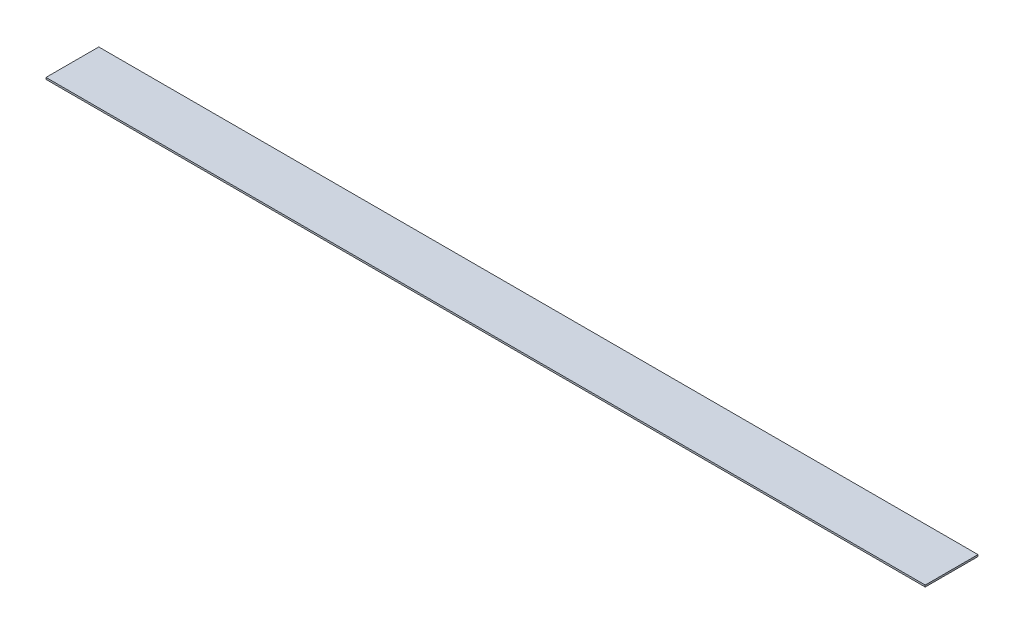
ISO-10303-21;
HEADER;
FILE_DESCRIPTION(('STEP AP214'),'2;1');
FILE_NAME('part.step','',(''),(''),'','','');
FILE_SCHEMA(('AUTOMOTIVE_DESIGN { 1 0 10303 214 1 1 1 1 }'));
ENDSEC;
DATA;
#1=APPLICATION_CONTEXT('core data for automotive mechanical design processes');
#2=APPLICATION_PROTOCOL_DEFINITION('international standard','automotive_design',2000,#1);
#3=PRODUCT_CONTEXT('',#1,'mechanical');
#4=PRODUCT('Part','Part','',(#3));
#5=PRODUCT_RELATED_PRODUCT_CATEGORY('part','',(#4));
#6=PRODUCT_DEFINITION_FORMATION('','',#4);
#7=PRODUCT_DEFINITION_CONTEXT('part definition',#1,'design');
#8=PRODUCT_DEFINITION('design','',#6,#7);
#9=PRODUCT_DEFINITION_SHAPE('','',#8);
#10=(LENGTH_UNIT() NAMED_UNIT(*) SI_UNIT(.MILLI.,.METRE.));
#11=(NAMED_UNIT(*) PLANE_ANGLE_UNIT() SI_UNIT($,.RADIAN.));
#12=(NAMED_UNIT(*) SI_UNIT($,.STERADIAN.) SOLID_ANGLE_UNIT());
#13=UNCERTAINTY_MEASURE_WITH_UNIT(LENGTH_MEASURE(1.E-05),#10,'distance_accuracy_value','');
#14=(GEOMETRIC_REPRESENTATION_CONTEXT(3) GLOBAL_UNCERTAINTY_ASSIGNED_CONTEXT((#13)) GLOBAL_UNIT_ASSIGNED_CONTEXT((#10,
#11,#12)) REPRESENTATION_CONTEXT('',''));
#15=CARTESIAN_POINT('',(0.,0.,0.));
#16=DIRECTION('',(0.,0.,1.));
#17=DIRECTION('',(1.,0.,0.));
#18=AXIS2_PLACEMENT_3D('',#15,#16,#17);
#19=CARTESIAN_POINT('',(0.,-25.4,381.));
#20=DIRECTION('',(-1.,0.,0.));
#21=DIRECTION('',(0.,0.,1.));
#22=AXIS2_PLACEMENT_3D('',#19,#20,#21);
#23=PLANE('',#22);
#24=DIRECTION('',(0.,0.,1.));
#25=VECTOR('',#24,1.);
#26=CARTESIAN_POINT('',(0.,0.,381.));
#27=LINE('',#26,#25);
#28=CARTESIAN_POINT('',(0.,0.,-381.));
#29=VERTEX_POINT('',#28);
#30=CARTESIAN_POINT('',(0.,0.,381.));
#31=VERTEX_POINT('',#30);
#32=EDGE_CURVE('E95',#29,#31,#27,.T.);
#33=ORIENTED_EDGE('',*,*,#32,.F.);
#34=DIRECTION('',(0.,1.,0.));
#35=VECTOR('',#34,1.);
#36=CARTESIAN_POINT('',(0.,-25.4,-381.));
#37=LINE('',#36,#35);
#38=CARTESIAN_POINT('',(0.,-25.4,-381.));
#39=VERTEX_POINT('',#38);
#40=EDGE_CURVE('E11',#39,#29,#37,.T.);
#41=ORIENTED_EDGE('',*,*,#40,.F.);
#42=DIRECTION('',(0.,0.,1.));
#43=VECTOR('',#42,1.);
#44=CARTESIAN_POINT('',(0.,-25.4,381.));
#45=LINE('',#44,#43);
#46=CARTESIAN_POINT('',(0.,-25.4,381.));
#47=VERTEX_POINT('',#46);
#48=EDGE_CURVE('E89',#39,#47,#45,.T.);
#49=ORIENTED_EDGE('',*,*,#48,.T.);
#50=DIRECTION('',(0.,1.,0.));
#51=VECTOR('',#50,1.);
#52=CARTESIAN_POINT('',(0.,-25.4,381.));
#53=LINE('',#52,#51);
#54=EDGE_CURVE('E34',#47,#31,#53,.T.);
#55=ORIENTED_EDGE('',*,*,#54,.T.);
#56=EDGE_LOOP('',(#33,#41,#49,#55));
#57=FACE_BOUND('',#56,.T.);
#58=ADVANCED_FACE('F31',(#57),#23,.T.);
#59=CARTESIAN_POINT('',(0.,-25.4,-381.));
#60=DIRECTION('',(0.,0.,-1.));
#61=DIRECTION('',(-1.,0.,0.));
#62=AXIS2_PLACEMENT_3D('',#59,#60,#61);
#63=PLANE('',#62);
#64=DIRECTION('',(-1.,0.,0.));
#65=VECTOR('',#64,1.);
#66=CARTESIAN_POINT('',(0.,0.,-381.));
#67=LINE('',#66,#65);
#68=CARTESIAN_POINT('',(12700.,0.,-381.));
#69=VERTEX_POINT('',#68);
#70=EDGE_CURVE('E91',#69,#29,#67,.T.);
#71=ORIENTED_EDGE('',*,*,#70,.F.);
#72=DIRECTION('',(0.,1.,0.));
#73=VECTOR('',#72,1.);
#74=CARTESIAN_POINT('',(12700.,-25.4,-381.));
#75=LINE('',#74,#73);
#76=CARTESIAN_POINT('',(12700.,-25.4,-381.));
#77=VERTEX_POINT('',#76);
#78=EDGE_CURVE('E40',#77,#69,#75,.T.);
#79=ORIENTED_EDGE('',*,*,#78,.F.);
#80=DIRECTION('',(-1.,0.,0.));
#81=VECTOR('',#80,1.);
#82=CARTESIAN_POINT('',(0.,-25.4,-381.));
#83=LINE('',#82,#81);
#84=EDGE_CURVE('E86',#77,#39,#83,.T.);
#85=ORIENTED_EDGE('',*,*,#84,.T.);
#86=ORIENTED_EDGE('',*,*,#40,.T.);
#87=EDGE_LOOP('',(#71,#79,#85,#86));
#88=FACE_BOUND('',#87,.T.);
#89=ADVANCED_FACE('F105',(#88),#63,.T.);
#90=CARTESIAN_POINT('',(12700.,-25.4,381.));
#91=DIRECTION('',(1.,0.,0.));
#92=DIRECTION('',(0.,0.,-1.));
#93=AXIS2_PLACEMENT_3D('',#90,#91,#92);
#94=PLANE('',#93);
#95=DIRECTION('',(0.,0.,-1.));
#96=VECTOR('',#95,1.);
#97=CARTESIAN_POINT('',(12700.,0.,381.));
#98=LINE('',#97,#96);
#99=CARTESIAN_POINT('',(12700.,0.,381.));
#100=VERTEX_POINT('',#99);
#101=EDGE_CURVE('E81',#100,#69,#98,.T.);
#102=ORIENTED_EDGE('',*,*,#101,.F.);
#103=DIRECTION('',(0.,1.,0.));
#104=VECTOR('',#103,1.);
#105=CARTESIAN_POINT('',(12700.,-25.4,381.));
#106=LINE('',#105,#104);
#107=CARTESIAN_POINT('',(12700.,-25.4,381.));
#108=VERTEX_POINT('',#107);
#109=EDGE_CURVE('E76',#108,#100,#106,.T.);
#110=ORIENTED_EDGE('',*,*,#109,.F.);
#111=DIRECTION('',(0.,0.,-1.));
#112=VECTOR('',#111,1.);
#113=CARTESIAN_POINT('',(12700.,-25.4,381.));
#114=LINE('',#113,#112);
#115=EDGE_CURVE('E79',#108,#77,#114,.T.);
#116=ORIENTED_EDGE('',*,*,#115,.T.);
#117=ORIENTED_EDGE('',*,*,#78,.T.);
#118=EDGE_LOOP('',(#102,#110,#116,#117));
#119=FACE_BOUND('',#118,.T.);
#120=ADVANCED_FACE('F78',(#119),#94,.T.);
#121=CARTESIAN_POINT('',(0.,-25.4,381.));
#122=DIRECTION('',(0.,0.,1.));
#123=DIRECTION('',(1.,0.,0.));
#124=AXIS2_PLACEMENT_3D('',#121,#122,#123);
#125=PLANE('',#124);
#126=DIRECTION('',(1.,0.,0.));
#127=VECTOR('',#126,1.);
#128=CARTESIAN_POINT('',(0.,0.,381.));
#129=LINE('',#128,#127);
#130=EDGE_CURVE('E98',#31,#100,#129,.T.);
#131=ORIENTED_EDGE('',*,*,#130,.F.);
#132=ORIENTED_EDGE('',*,*,#54,.F.);
#133=DIRECTION('',(1.,0.,0.));
#134=VECTOR('',#133,1.);
#135=CARTESIAN_POINT('',(0.,-25.4,381.));
#136=LINE('',#135,#134);
#137=EDGE_CURVE('E85',#47,#108,#136,.T.);
#138=ORIENTED_EDGE('',*,*,#137,.T.);
#139=ORIENTED_EDGE('',*,*,#109,.T.);
#140=EDGE_LOOP('',(#131,#132,#138,#139));
#141=FACE_BOUND('',#140,.T.);
#142=ADVANCED_FACE('F88',(#141),#125,.T.);
#143=CARTESIAN_POINT('',(0.,-25.4,-381.));
#144=DIRECTION('',(0.,-1.,0.));
#145=DIRECTION('',(0.,0.,-1.));
#146=AXIS2_PLACEMENT_3D('',#143,#144,#145);
#147=PLANE('',#146);
#148=ORIENTED_EDGE('',*,*,#48,.F.);
#149=ORIENTED_EDGE('',*,*,#84,.F.);
#150=ORIENTED_EDGE('',*,*,#115,.F.);
#151=ORIENTED_EDGE('',*,*,#137,.F.);
#152=EDGE_LOOP('',(#148,#149,#150,#151));
#153=FACE_BOUND('',#152,.T.);
#154=ADVANCED_FACE('F84',(#153),#147,.T.);
#155=CARTESIAN_POINT('',(0.,0.,-381.));
#156=DIRECTION('',(0.,-1.,0.));
#157=DIRECTION('',(0.,0.,-1.));
#158=AXIS2_PLACEMENT_3D('',#155,#156,#157);
#159=PLANE('',#158);
#160=ORIENTED_EDGE('',*,*,#32,.T.);
#161=ORIENTED_EDGE('',*,*,#130,.T.);
#162=ORIENTED_EDGE('',*,*,#101,.T.);
#163=ORIENTED_EDGE('',*,*,#70,.T.);
#164=EDGE_LOOP('',(#160,#161,#162,#163));
#165=FACE_BOUND('',#164,.T.);
#166=ADVANCED_FACE('F104',(#165),#159,.F.);
#167=CLOSED_SHELL('',(#58,#89,#120,#142,#154,#166));
#168=MANIFOLD_SOLID_BREP('B2',#167);
#169=ADVANCED_BREP_SHAPE_REPRESENTATION('',(#18,#168),#14);
#170=SHAPE_DEFINITION_REPRESENTATION(#9,#169);
ENDSEC;
END-ISO-10303-21;
